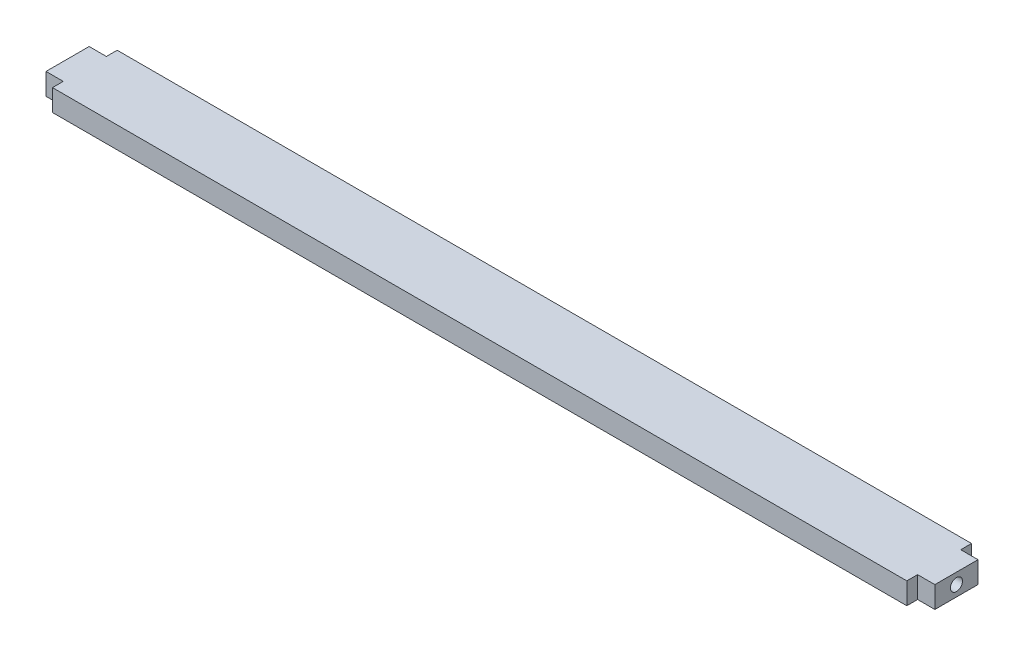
from build123d import *

# Parameters (mm, degrees)
EXTRUDE_1_DEPTH     = 5
CUT_EXTRUDE_START   = 93
SKETCH_2_R          = 1.4
CUT_EXTRUDE_1_DEPTH = 10


with BuildPart() as part:
    # Sketch 1 → Extrude 1 (new body)
    with BuildSketch(Plane(origin=(0, 0, 0), x_dir=(1, 0, 0), z_dir=(0, 1, 0))):
        Polygon((-99, 7.5), (-99, 5), (-103, 5), (-103, -5), (-99, -5), (-99, -7.5), (99, -7.5), (99, -5), (103, -5), (103, 5), (99, 5), (99, 7.5), align=None)
    extrude(amount=EXTRUDE_1_DEPTH)

    # Sketch 2 → Cut-Extrude 1 (cut)
    with BuildSketch(Plane(origin=(0, 0, 0), x_dir=(0, 0, -1), z_dir=(1, 0, 0)).offset(CUT_EXTRUDE_START)):
        with Locations((0, 2.5)):
            Circle(SKETCH_2_R)
    cut_extrude_1 = extrude(amount=CUT_EXTRUDE_1_DEPTH, mode=Mode.SUBTRACT)

    # Mirror 1: Cut-Extrude 1 across plane
    add(cut_extrude_1.mirror(Plane(origin=(0, 0, 0), x_dir=(0, 0, 1), z_dir=(1, 0, 0))), mode=Mode.SUBTRACT)


solid = part.part
